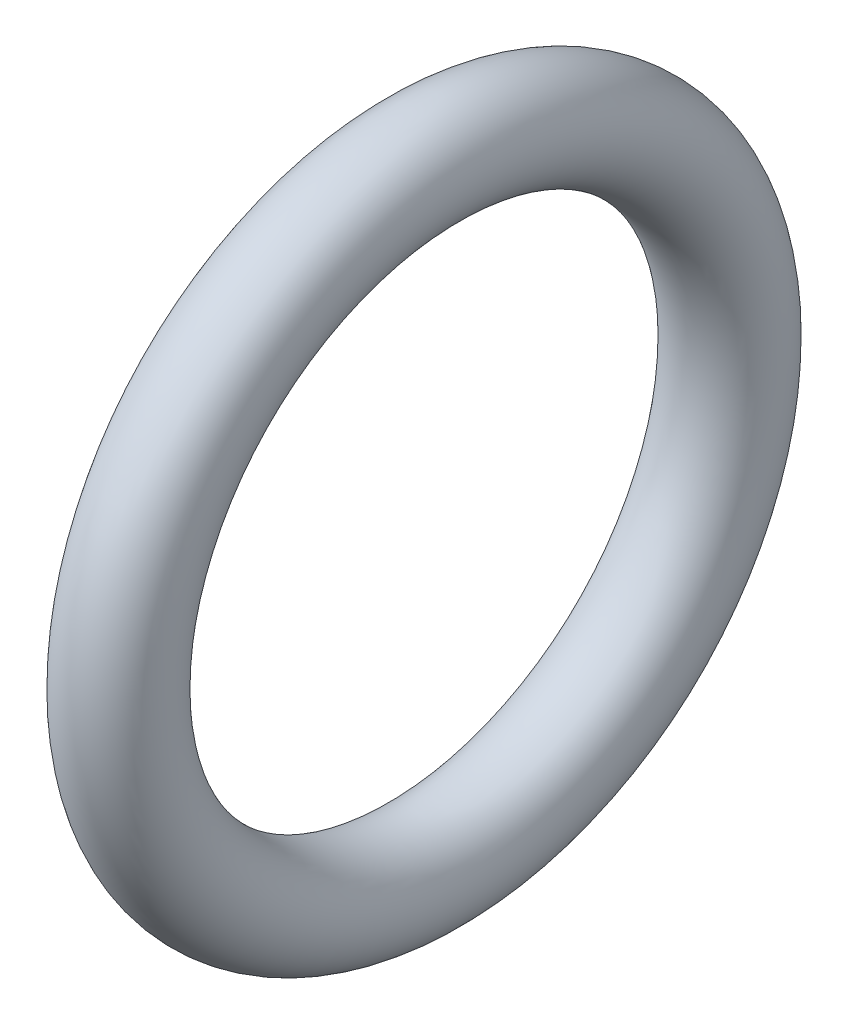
from build123d import *

# Parameters (mm, degrees)
ESQUISSE1_R = 1.35


with BuildPart() as part:
    # Esquisse1 → Base-R_volution (revolve)
    with BuildSketch(Plane.XY, mode=Mode.PRIVATE) as base_r_volution_sk:
        with Locations((0, 8.15)):
            Circle(ESQUISSE1_R)
    revolve(base_r_volution_sk.sketch.rotate(Axis((0, 0, 0), (1, 0, 0)), 90), axis=Axis((0, 0, 0), (1, 0, 0)))


solid = part.part
